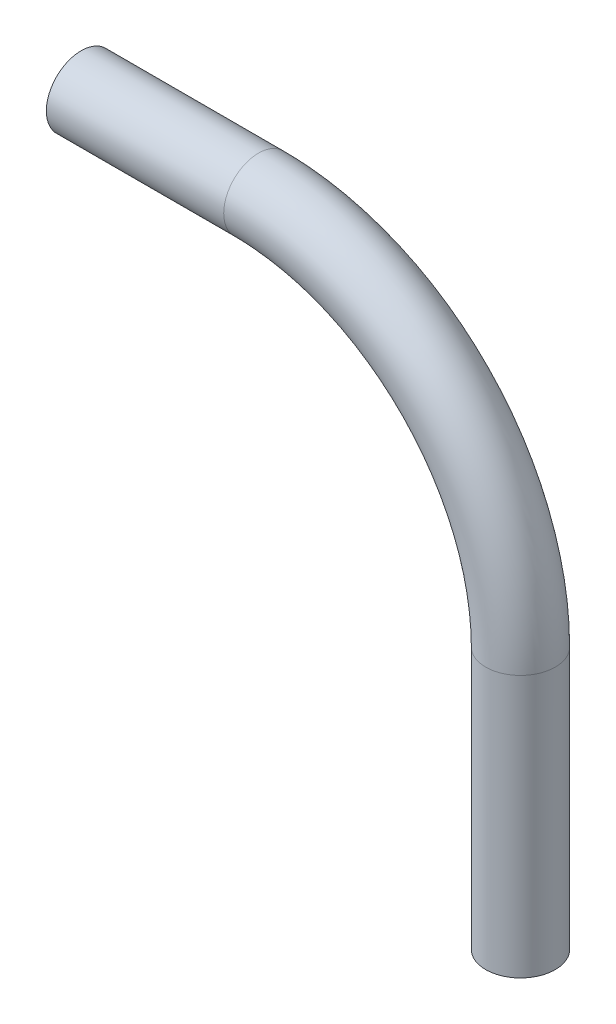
ISO-10303-21;
HEADER;
FILE_DESCRIPTION(('STEP AP214'),'2;1');
FILE_NAME('part.step','',(''),(''),'','','');
FILE_SCHEMA(('AUTOMOTIVE_DESIGN { 1 0 10303 214 1 1 1 1 }'));
ENDSEC;
DATA;
#1=APPLICATION_CONTEXT('core data for automotive mechanical design processes');
#2=APPLICATION_PROTOCOL_DEFINITION('international standard','automotive_design',2000,#1);
#3=PRODUCT_CONTEXT('',#1,'mechanical');
#4=PRODUCT('Part','Part','',(#3));
#5=PRODUCT_RELATED_PRODUCT_CATEGORY('part','',(#4));
#6=PRODUCT_DEFINITION_FORMATION('','',#4);
#7=PRODUCT_DEFINITION_CONTEXT('part definition',#1,'design');
#8=PRODUCT_DEFINITION('design','',#6,#7);
#9=PRODUCT_DEFINITION_SHAPE('','',#8);
#10=(LENGTH_UNIT() NAMED_UNIT(*) SI_UNIT(.MILLI.,.METRE.));
#11=(NAMED_UNIT(*) PLANE_ANGLE_UNIT() SI_UNIT($,.RADIAN.));
#12=(NAMED_UNIT(*) SI_UNIT($,.STERADIAN.) SOLID_ANGLE_UNIT());
#13=UNCERTAINTY_MEASURE_WITH_UNIT(LENGTH_MEASURE(1.E-05),#10,'distance_accuracy_value','');
#14=(GEOMETRIC_REPRESENTATION_CONTEXT(3) GLOBAL_UNCERTAINTY_ASSIGNED_CONTEXT((#13)) GLOBAL_UNIT_ASSIGNED_CONTEXT((#10,
#11,#12)) REPRESENTATION_CONTEXT('',''));
#15=CARTESIAN_POINT('',(0.,0.,0.));
#16=DIRECTION('',(0.,0.,1.));
#17=DIRECTION('',(1.,0.,0.));
#18=AXIS2_PLACEMENT_3D('',#15,#16,#17);
#19=CARTESIAN_POINT('',(-130.,130.,0.));
#20=DIRECTION('',(0.,0.,1.));
#21=DIRECTION('',(1.,0.,0.));
#22=AXIS2_PLACEMENT_3D('',#19,#20,#21);
#23=TOROIDAL_SURFACE('',#22,130.,14.5);
#24=CARTESIAN_POINT('',(-130.,260.,0.));
#25=DIRECTION('',(-1.,0.,0.));
#26=DIRECTION('',(0.,-1.,0.));
#27=AXIS2_PLACEMENT_3D('',#24,#25,#26);
#28=CIRCLE('',#27,14.5);
#29=CARTESIAN_POINT('',(-130.,245.5,0.));
#30=VERTEX_POINT('',#29);
#31=EDGE_CURVE('E35',#30,#30,#28,.T.);
#32=ORIENTED_EDGE('',*,*,#31,.T.);
#33=EDGE_LOOP('',(#32));
#34=FACE_BOUND('',#33,.T.);
#35=CARTESIAN_POINT('',(0.,130.,0.));
#36=DIRECTION('',(0.,1.,0.));
#37=DIRECTION('',(-1.,0.,0.));
#38=AXIS2_PLACEMENT_3D('',#35,#36,#37);
#39=CIRCLE('',#38,14.5);
#40=CARTESIAN_POINT('',(-14.5,130.,0.));
#41=VERTEX_POINT('',#40);
#42=EDGE_CURVE('E38',#41,#41,#39,.F.);
#43=ORIENTED_EDGE('',*,*,#42,.T.);
#44=EDGE_LOOP('',(#43));
#45=FACE_BOUND('',#44,.T.);
#46=ADVANCED_FACE('F15',(#34,#45),#23,.F.);
#47=CARTESIAN_POINT('',(0.,0.,0.));
#48=DIRECTION('',(0.,1.,0.));
#49=DIRECTION('',(-1.,0.,0.));
#50=AXIS2_PLACEMENT_3D('',#47,#48,#49);
#51=CYLINDRICAL_SURFACE('',#50,14.5);
#52=ORIENTED_EDGE('',*,*,#42,.F.);
#53=EDGE_LOOP('',(#52));
#54=FACE_BOUND('',#53,.T.);
#55=CARTESIAN_POINT('',(0.,0.,0.));
#56=DIRECTION('',(0.,1.,0.));
#57=DIRECTION('',(-1.,0.,0.));
#58=AXIS2_PLACEMENT_3D('',#55,#56,#57);
#59=CIRCLE('',#58,14.5);
#60=CARTESIAN_POINT('',(-14.5,0.,0.));
#61=VERTEX_POINT('',#60);
#62=EDGE_CURVE('E19',#61,#61,#59,.F.);
#63=ORIENTED_EDGE('',*,*,#62,.T.);
#64=EDGE_LOOP('',(#63));
#65=FACE_BOUND('',#64,.T.);
#66=ADVANCED_FACE('F56',(#54,#65),#51,.F.);
#67=CARTESIAN_POINT('',(-130.,260.,0.));
#68=DIRECTION('',(-1.,0.,0.));
#69=DIRECTION('',(0.,-1.,0.));
#70=AXIS2_PLACEMENT_3D('',#67,#68,#69);
#71=CYLINDRICAL_SURFACE('',#70,14.5);
#72=CARTESIAN_POINT('',(-218.00846928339,260.,0.));
#73=DIRECTION('',(-1.,0.,0.));
#74=DIRECTION('',(0.,-1.,0.));
#75=AXIS2_PLACEMENT_3D('',#72,#73,#74);
#76=CIRCLE('',#75,14.5);
#77=CARTESIAN_POINT('',(-218.00846928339,245.5,0.));
#78=VERTEX_POINT('',#77);
#79=EDGE_CURVE('E49',#78,#78,#76,.F.);
#80=ORIENTED_EDGE('',*,*,#79,.F.);
#81=EDGE_LOOP('',(#80));
#82=FACE_BOUND('',#81,.T.);
#83=ORIENTED_EDGE('',*,*,#31,.F.);
#84=EDGE_LOOP('',(#83));
#85=FACE_BOUND('',#84,.T.);
#86=ADVANCED_FACE('F62',(#82,#85),#71,.F.);
#87=CARTESIAN_POINT('',(0.,0.,0.));
#88=DIRECTION('',(0.,1.,0.));
#89=DIRECTION('',(0.,0.,1.));
#90=AXIS2_PLACEMENT_3D('',#87,#88,#89);
#91=PLANE('',#90);
#92=ORIENTED_EDGE('',*,*,#62,.F.);
#93=EDGE_LOOP('',(#92));
#94=FACE_BOUND('',#93,.T.);
#95=CARTESIAN_POINT('',(0.,0.,0.));
#96=DIRECTION('',(0.,1.,0.));
#97=DIRECTION('',(-1.,0.,0.));
#98=AXIS2_PLACEMENT_3D('',#95,#96,#97);
#99=CIRCLE('',#98,17.25);
#100=CARTESIAN_POINT('',(-17.25,0.,0.));
#101=VERTEX_POINT('',#100);
#102=EDGE_CURVE('E47',#101,#101,#99,.T.);
#103=ORIENTED_EDGE('',*,*,#102,.F.);
#104=EDGE_LOOP('',(#103));
#105=FACE_BOUND('',#104,.T.);
#106=ADVANCED_FACE('F58',(#94,#105),#91,.F.);
#107=CARTESIAN_POINT('',(-218.00846928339,260.,0.));
#108=DIRECTION('',(-1.,0.,0.));
#109=DIRECTION('',(0.,-1.,0.));
#110=AXIS2_PLACEMENT_3D('',#107,#108,#109);
#111=PLANE('',#110);
#112=ORIENTED_EDGE('',*,*,#79,.T.);
#113=EDGE_LOOP('',(#112));
#114=FACE_BOUND('',#113,.T.);
#115=CARTESIAN_POINT('',(-218.00846928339,260.,0.));
#116=DIRECTION('',(-1.,0.,0.));
#117=DIRECTION('',(0.,-1.,0.));
#118=AXIS2_PLACEMENT_3D('',#115,#116,#117);
#119=CIRCLE('',#118,17.25);
#120=CARTESIAN_POINT('',(-218.00846928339,242.75,0.));
#121=VERTEX_POINT('',#120);
#122=EDGE_CURVE('E28',#121,#121,#119,.F.);
#123=ORIENTED_EDGE('',*,*,#122,.F.);
#124=EDGE_LOOP('',(#123));
#125=FACE_BOUND('',#124,.T.);
#126=ADVANCED_FACE('F61',(#114,#125),#111,.T.);
#127=CARTESIAN_POINT('',(0.,0.,0.));
#128=DIRECTION('',(0.,1.,0.));
#129=DIRECTION('',(-1.,0.,0.));
#130=AXIS2_PLACEMENT_3D('',#127,#128,#129);
#131=CYLINDRICAL_SURFACE('',#130,17.25);
#132=CARTESIAN_POINT('',(0.,130.,0.));
#133=DIRECTION('',(0.,1.,0.));
#134=DIRECTION('',(1.,0.,0.));
#135=AXIS2_PLACEMENT_3D('',#132,#133,#134);
#136=CIRCLE('',#135,17.25);
#137=CARTESIAN_POINT('',(17.25,130.,0.));
#138=VERTEX_POINT('',#137);
#139=EDGE_CURVE('E23',#138,#138,#136,.T.);
#140=ORIENTED_EDGE('',*,*,#139,.F.);
#141=EDGE_LOOP('',(#140));
#142=FACE_BOUND('',#141,.T.);
#143=ORIENTED_EDGE('',*,*,#102,.T.);
#144=EDGE_LOOP('',(#143));
#145=FACE_BOUND('',#144,.T.);
#146=ADVANCED_FACE('F66',(#142,#145),#131,.T.);
#147=CARTESIAN_POINT('',(-130.,260.,0.));
#148=DIRECTION('',(-1.,0.,0.));
#149=DIRECTION('',(0.,-1.,0.));
#150=AXIS2_PLACEMENT_3D('',#147,#148,#149);
#151=CYLINDRICAL_SURFACE('',#150,17.25);
#152=ORIENTED_EDGE('',*,*,#122,.T.);
#153=EDGE_LOOP('',(#152));
#154=FACE_BOUND('',#153,.T.);
#155=CARTESIAN_POINT('',(-130.,260.,0.));
#156=DIRECTION('',(1.,0.,0.));
#157=DIRECTION('',(0.,1.,0.));
#158=AXIS2_PLACEMENT_3D('',#155,#156,#157);
#159=CIRCLE('',#158,17.25);
#160=CARTESIAN_POINT('',(-130.,277.25,0.));
#161=VERTEX_POINT('',#160);
#162=EDGE_CURVE('E10',#161,#161,#159,.T.);
#163=ORIENTED_EDGE('',*,*,#162,.F.);
#164=EDGE_LOOP('',(#163));
#165=FACE_BOUND('',#164,.T.);
#166=ADVANCED_FACE('F68',(#154,#165),#151,.T.);
#167=CARTESIAN_POINT('',(-130.,130.,0.));
#168=DIRECTION('',(0.,0.,1.));
#169=DIRECTION('',(1.,0.,0.));
#170=AXIS2_PLACEMENT_3D('',#167,#168,#169);
#171=TOROIDAL_SURFACE('',#170,130.,17.25);
#172=ORIENTED_EDGE('',*,*,#162,.T.);
#173=EDGE_LOOP('',(#172));
#174=FACE_BOUND('',#173,.T.);
#175=ORIENTED_EDGE('',*,*,#139,.T.);
#176=EDGE_LOOP('',(#175));
#177=FACE_BOUND('',#176,.T.);
#178=ADVANCED_FACE('F17',(#174,#177),#171,.T.);
#179=CLOSED_SHELL('',(#46,#66,#86,#106,#126,#146,#166,#178));
#180=MANIFOLD_SOLID_BREP('B1',#179);
#181=ADVANCED_BREP_SHAPE_REPRESENTATION('',(#18,#180),#14);
#182=SHAPE_DEFINITION_REPRESENTATION(#9,#181);
ENDSEC;
END-ISO-10303-21;
